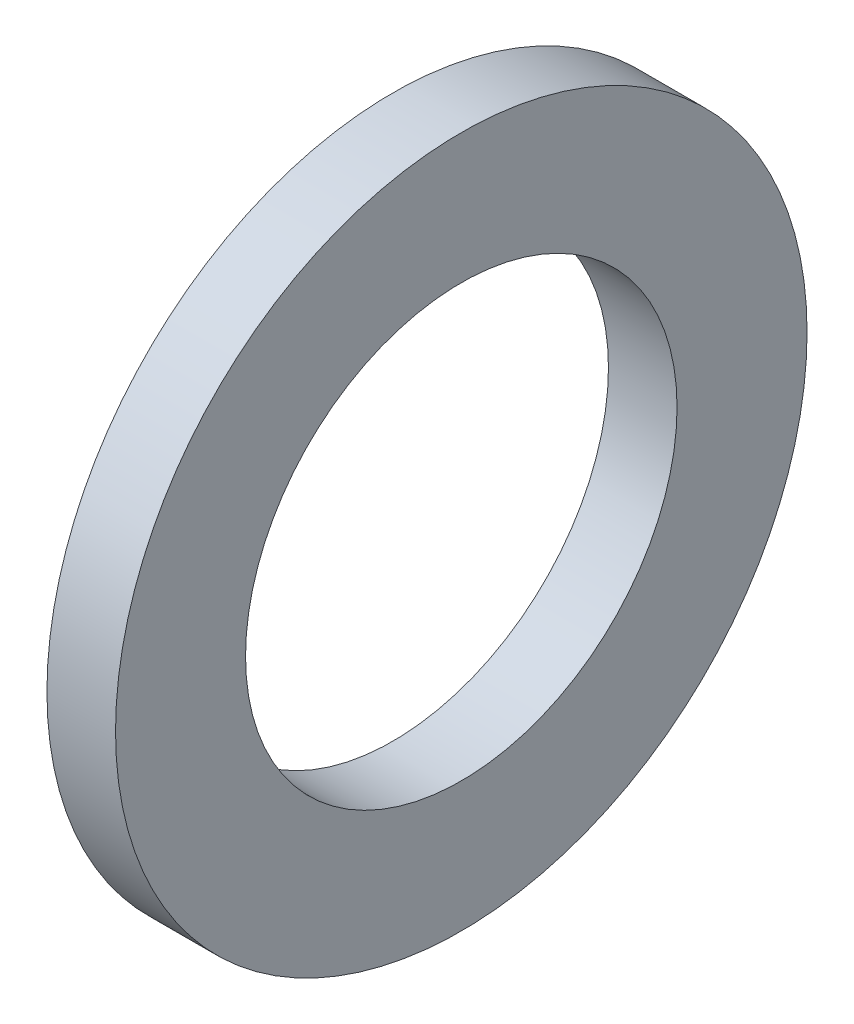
ISO-10303-21;
HEADER;
FILE_DESCRIPTION(('STEP AP214'),'2;1');
FILE_NAME('part.step','',(''),(''),'','','');
FILE_SCHEMA(('AUTOMOTIVE_DESIGN { 1 0 10303 214 1 1 1 1 }'));
ENDSEC;
DATA;
#1=APPLICATION_CONTEXT('core data for automotive mechanical design processes');
#2=APPLICATION_PROTOCOL_DEFINITION('international standard','automotive_design',2000,#1);
#3=PRODUCT_CONTEXT('',#1,'mechanical');
#4=PRODUCT('Part','Part','',(#3));
#5=PRODUCT_RELATED_PRODUCT_CATEGORY('part','',(#4));
#6=PRODUCT_DEFINITION_FORMATION('','',#4);
#7=PRODUCT_DEFINITION_CONTEXT('part definition',#1,'design');
#8=PRODUCT_DEFINITION('design','',#6,#7);
#9=PRODUCT_DEFINITION_SHAPE('','',#8);
#10=(LENGTH_UNIT() NAMED_UNIT(*) SI_UNIT(.MILLI.,.METRE.));
#11=(NAMED_UNIT(*) PLANE_ANGLE_UNIT() SI_UNIT($,.RADIAN.));
#12=(NAMED_UNIT(*) SI_UNIT($,.STERADIAN.) SOLID_ANGLE_UNIT());
#13=UNCERTAINTY_MEASURE_WITH_UNIT(LENGTH_MEASURE(1.E-05),#10,'distance_accuracy_value','');
#14=(GEOMETRIC_REPRESENTATION_CONTEXT(3) GLOBAL_UNCERTAINTY_ASSIGNED_CONTEXT((#13)) GLOBAL_UNIT_ASSIGNED_CONTEXT((#10,
#11,#12)) REPRESENTATION_CONTEXT('',''));
#15=CARTESIAN_POINT('',(0.,0.,0.));
#16=DIRECTION('',(0.,0.,1.));
#17=DIRECTION('',(1.,0.,0.));
#18=AXIS2_PLACEMENT_3D('',#15,#16,#17);
#19=CARTESIAN_POINT('',(1.5748,7.9375,0.));
#20=DIRECTION('',(-1.,0.,0.));
#21=DIRECTION('',(0.,0.,1.));
#22=AXIS2_PLACEMENT_3D('',#19,#20,#21);
#23=PLANE('',#22);
#24=CARTESIAN_POINT('',(1.5748,0.,0.));
#25=DIRECTION('',(-1.,0.,0.));
#26=DIRECTION('',(0.,0.,1.));
#27=AXIS2_PLACEMENT_3D('',#24,#25,#26);
#28=CIRCLE('',#27,7.9375);
#29=CARTESIAN_POINT('',(1.5748,0.,7.9375));
#30=VERTEX_POINT('',#29);
#31=EDGE_CURVE('E10',#30,#30,#28,.T.);
#32=ORIENTED_EDGE('',*,*,#31,.F.);
#33=EDGE_LOOP('',(#32));
#34=FACE_BOUND('',#33,.T.);
#35=CARTESIAN_POINT('',(1.5748,0.,0.));
#36=DIRECTION('',(-1.,0.,0.));
#37=DIRECTION('',(0.,0.,1.));
#38=AXIS2_PLACEMENT_3D('',#35,#36,#37);
#39=CIRCLE('',#38,4.953);
#40=CARTESIAN_POINT('',(1.5748,0.,4.953));
#41=VERTEX_POINT('',#40);
#42=EDGE_CURVE('E392',#41,#41,#39,.T.);
#43=ORIENTED_EDGE('',*,*,#42,.T.);
#44=EDGE_LOOP('',(#43));
#45=FACE_BOUND('',#44,.T.);
#46=ADVANCED_FACE('F378',(#34,#45),#23,.F.);
#47=CARTESIAN_POINT('',(0.,0.,0.));
#48=DIRECTION('',(-1.,0.,0.));
#49=DIRECTION('',(0.,0.,1.));
#50=AXIS2_PLACEMENT_3D('',#47,#48,#49);
#51=CYLINDRICAL_SURFACE('',#50,7.9375);
#52=CARTESIAN_POINT('',(0.,0.,0.));
#53=DIRECTION('',(-1.,0.,0.));
#54=DIRECTION('',(0.,0.,1.));
#55=AXIS2_PLACEMENT_3D('',#52,#53,#54);
#56=CIRCLE('',#55,7.9375);
#57=CARTESIAN_POINT('',(0.,0.,7.9375));
#58=VERTEX_POINT('',#57);
#59=EDGE_CURVE('E384',#58,#58,#56,.T.);
#60=ORIENTED_EDGE('',*,*,#59,.F.);
#61=EDGE_LOOP('',(#60));
#62=FACE_BOUND('',#61,.T.);
#63=ORIENTED_EDGE('',*,*,#31,.T.);
#64=EDGE_LOOP('',(#63));
#65=FACE_BOUND('',#64,.T.);
#66=ADVANCED_FACE('F407',(#62,#65),#51,.T.);
#67=CARTESIAN_POINT('',(0.,4.953,0.));
#68=DIRECTION('',(1.,0.,0.));
#69=DIRECTION('',(0.,0.,-1.));
#70=AXIS2_PLACEMENT_3D('',#67,#68,#69);
#71=PLANE('',#70);
#72=CARTESIAN_POINT('',(0.,0.,0.));
#73=DIRECTION('',(-1.,0.,0.));
#74=DIRECTION('',(0.,0.,1.));
#75=AXIS2_PLACEMENT_3D('',#72,#73,#74);
#76=CIRCLE('',#75,4.953);
#77=CARTESIAN_POINT('',(0.,0.,4.953));
#78=VERTEX_POINT('',#77);
#79=EDGE_CURVE('E388',#78,#78,#76,.T.);
#80=ORIENTED_EDGE('',*,*,#79,.F.);
#81=EDGE_LOOP('',(#80));
#82=FACE_BOUND('',#81,.T.);
#83=ORIENTED_EDGE('',*,*,#59,.T.);
#84=EDGE_LOOP('',(#83));
#85=FACE_BOUND('',#84,.T.);
#86=ADVANCED_FACE('F402',(#82,#85),#71,.F.);
#87=CARTESIAN_POINT('',(0.,0.,0.));
#88=DIRECTION('',(-1.,0.,0.));
#89=DIRECTION('',(0.,0.,1.));
#90=AXIS2_PLACEMENT_3D('',#87,#88,#89);
#91=CYLINDRICAL_SURFACE('',#90,4.953);
#92=ORIENTED_EDGE('',*,*,#42,.F.);
#93=EDGE_LOOP('',(#92));
#94=FACE_BOUND('',#93,.T.);
#95=ORIENTED_EDGE('',*,*,#79,.T.);
#96=EDGE_LOOP('',(#95));
#97=FACE_BOUND('',#96,.T.);
#98=ADVANCED_FACE('F399',(#94,#97),#91,.F.);
#99=CLOSED_SHELL('',(#46,#66,#86,#98));
#100=MANIFOLD_SOLID_BREP('B2',#99);
#101=ADVANCED_BREP_SHAPE_REPRESENTATION('',(#18,#100),#14);
#102=SHAPE_DEFINITION_REPRESENTATION(#9,#101);
ENDSEC;
END-ISO-10303-21;
